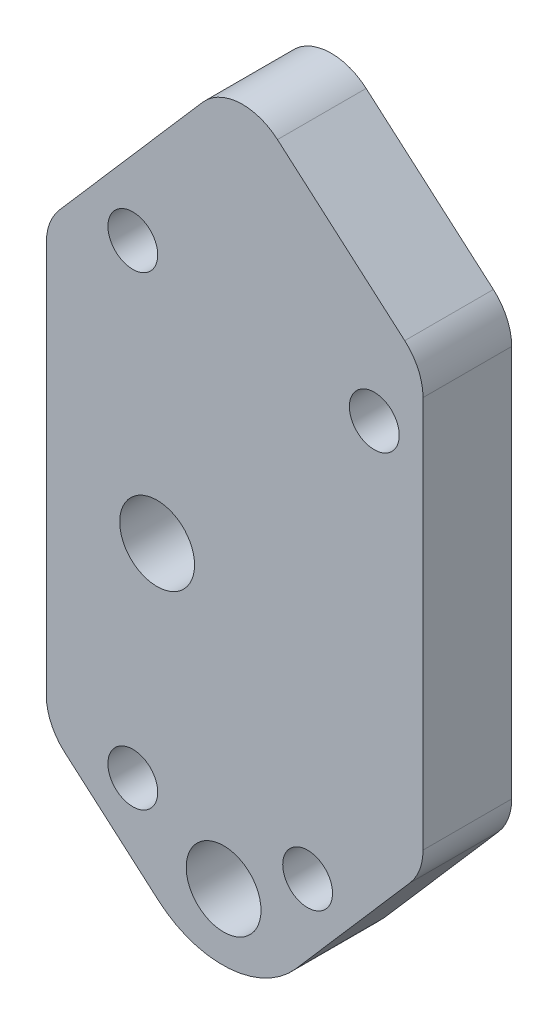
ISO-10303-21;
HEADER;
FILE_DESCRIPTION(('STEP AP214'),'2;1');
FILE_NAME('part.step','',(''),(''),'','','');
FILE_SCHEMA(('AUTOMOTIVE_DESIGN { 1 0 10303 214 1 1 1 1 }'));
ENDSEC;
DATA;
#1=APPLICATION_CONTEXT('core data for automotive mechanical design processes');
#2=APPLICATION_PROTOCOL_DEFINITION('international standard','automotive_design',2000,#1);
#3=PRODUCT_CONTEXT('',#1,'mechanical');
#4=PRODUCT('Part','Part','',(#3));
#5=PRODUCT_RELATED_PRODUCT_CATEGORY('part','',(#4));
#6=PRODUCT_DEFINITION_FORMATION('','',#4);
#7=PRODUCT_DEFINITION_CONTEXT('part definition',#1,'design');
#8=PRODUCT_DEFINITION('design','',#6,#7);
#9=PRODUCT_DEFINITION_SHAPE('','',#8);
#10=(LENGTH_UNIT() NAMED_UNIT(*) SI_UNIT(.MILLI.,.METRE.));
#11=(NAMED_UNIT(*) PLANE_ANGLE_UNIT() SI_UNIT($,.RADIAN.));
#12=(NAMED_UNIT(*) SI_UNIT($,.STERADIAN.) SOLID_ANGLE_UNIT());
#13=UNCERTAINTY_MEASURE_WITH_UNIT(LENGTH_MEASURE(1.E-05),#10,'distance_accuracy_value','');
#14=(GEOMETRIC_REPRESENTATION_CONTEXT(3) GLOBAL_UNCERTAINTY_ASSIGNED_CONTEXT((#13)) GLOBAL_UNIT_ASSIGNED_CONTEXT((#10,
#11,#12)) REPRESENTATION_CONTEXT('',''));
#15=CARTESIAN_POINT('',(0.,0.,0.));
#16=DIRECTION('',(0.,0.,1.));
#17=DIRECTION('',(1.,0.,0.));
#18=AXIS2_PLACEMENT_3D('',#15,#16,#17);
#19=CARTESIAN_POINT('',(-783.463,-50.7534898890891,84.6582));
#20=DIRECTION('',(0.,0.,-1.));
#21=DIRECTION('',(-1.,0.,0.));
#22=AXIS2_PLACEMENT_3D('',#19,#20,#21);
#23=CYLINDRICAL_SURFACE('',#22,7.61999999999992);
#24=CARTESIAN_POINT('',(-783.463,-50.7534898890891,71.9582));
#25=DIRECTION('',(0.,0.,-1.));
#26=DIRECTION('',(-1.,0.,0.));
#27=AXIS2_PLACEMENT_3D('',#24,#25,#26);
#28=CIRCLE('',#27,7.61999999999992);
#29=CARTESIAN_POINT('',(-775.843,-50.7534898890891,71.9582));
#30=VERTEX_POINT('',#29);
#31=CARTESIAN_POINT('',(-777.709670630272,-55.7498486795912,71.9582));
#32=VERTEX_POINT('',#31);
#33=EDGE_CURVE('E177',#30,#32,#28,.T.);
#34=ORIENTED_EDGE('',*,*,#33,.F.);
#35=DIRECTION('',(0.,0.,-1.));
#36=VECTOR('',#35,1.);
#37=CARTESIAN_POINT('',(-775.843,-50.7534898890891,84.6582));
#38=LINE('',#37,#36);
#39=CARTESIAN_POINT('',(-775.843,-50.7534898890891,84.6582));
#40=VERTEX_POINT('',#39);
#41=EDGE_CURVE('E11',#40,#30,#38,.T.);
#42=ORIENTED_EDGE('',*,*,#41,.F.);
#43=CARTESIAN_POINT('',(-783.463,-50.7534898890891,84.6582));
#44=DIRECTION('',(0.,0.,-1.));
#45=DIRECTION('',(-1.,0.,0.));
#46=AXIS2_PLACEMENT_3D('',#43,#44,#45);
#47=CIRCLE('',#46,7.61999999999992);
#48=CARTESIAN_POINT('',(-777.709670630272,-55.7498486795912,84.6582));
#49=VERTEX_POINT('',#48);
#50=EDGE_CURVE('E222',#40,#49,#47,.T.);
#51=ORIENTED_EDGE('',*,*,#50,.T.);
#52=DIRECTION('',(0.,0.,-1.));
#53=VECTOR('',#52,1.);
#54=CARTESIAN_POINT('',(-777.709670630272,-55.7498486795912,84.6582));
#55=LINE('',#54,#53);
#56=EDGE_CURVE('E52',#49,#32,#55,.T.);
#57=ORIENTED_EDGE('',*,*,#56,.T.);
#58=EDGE_LOOP('',(#34,#42,#51,#57));
#59=FACE_BOUND('',#58,.T.);
#60=ADVANCED_FACE('F49',(#59),#23,.T.);
#61=CARTESIAN_POINT('',(-775.843,5.39033140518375,84.6582));
#62=DIRECTION('',(1.,0.,0.));
#63=DIRECTION('',(0.,1.,0.));
#64=AXIS2_PLACEMENT_3D('',#61,#62,#63);
#65=PLANE('',#64);
#66=DIRECTION('',(0.,-1.,0.));
#67=VECTOR('',#66,1.);
#68=CARTESIAN_POINT('',(-775.843,5.39033140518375,71.9582));
#69=LINE('',#68,#67);
#70=CARTESIAN_POINT('',(-775.843,5.39033140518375,71.9582));
#71=VERTEX_POINT('',#70);
#72=EDGE_CURVE('E219',#71,#30,#69,.T.);
#73=ORIENTED_EDGE('',*,*,#72,.F.);
#74=DIRECTION('',(0.,0.,-1.));
#75=VECTOR('',#74,1.);
#76=CARTESIAN_POINT('',(-775.843,5.39033140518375,84.6582));
#77=LINE('',#76,#75);
#78=CARTESIAN_POINT('',(-775.843,5.39033140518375,84.6582));
#79=VERTEX_POINT('',#78);
#80=EDGE_CURVE('E59',#79,#71,#77,.T.);
#81=ORIENTED_EDGE('',*,*,#80,.F.);
#82=DIRECTION('',(0.,-1.,0.));
#83=VECTOR('',#82,1.);
#84=CARTESIAN_POINT('',(-775.843,5.39033140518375,84.6582));
#85=LINE('',#84,#83);
#86=EDGE_CURVE('E162',#79,#40,#85,.T.);
#87=ORIENTED_EDGE('',*,*,#86,.T.);
#88=ORIENTED_EDGE('',*,*,#41,.T.);
#89=EDGE_LOOP('',(#73,#81,#87,#88));
#90=FACE_BOUND('',#89,.T.);
#91=ADVANCED_FACE('F254',(#90),#65,.T.);
#92=CARTESIAN_POINT('',(-783.463,5.39033140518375,84.6582));
#93=DIRECTION('',(0.,0.,-1.));
#94=DIRECTION('',(-1.,0.,0.));
#95=AXIS2_PLACEMENT_3D('',#92,#93,#94);
#96=CYLINDRICAL_SURFACE('',#95,7.61999999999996);
#97=CARTESIAN_POINT('',(-783.463,5.39033140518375,71.9582));
#98=DIRECTION('',(0.,0.,-1.));
#99=DIRECTION('',(-1.,0.,0.));
#100=AXIS2_PLACEMENT_3D('',#97,#98,#99);
#101=CIRCLE('',#100,7.61999999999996);
#102=CARTESIAN_POINT('',(-778.466641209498,11.1436607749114,71.9582));
#103=VERTEX_POINT('',#102);
#104=EDGE_CURVE('E148',#103,#71,#101,.T.);
#105=ORIENTED_EDGE('',*,*,#104,.F.);
#106=DIRECTION('',(0.,0.,-1.));
#107=VECTOR('',#106,1.);
#108=CARTESIAN_POINT('',(-778.466641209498,11.1436607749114,84.6582));
#109=LINE('',#108,#107);
#110=CARTESIAN_POINT('',(-778.466641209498,11.1436607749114,84.6582));
#111=VERTEX_POINT('',#110);
#112=EDGE_CURVE('E143',#111,#103,#109,.T.);
#113=ORIENTED_EDGE('',*,*,#112,.F.);
#114=CARTESIAN_POINT('',(-783.463,5.39033140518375,84.6582));
#115=DIRECTION('',(0.,0.,-1.));
#116=DIRECTION('',(-1.,0.,0.));
#117=AXIS2_PLACEMENT_3D('',#114,#115,#116);
#118=CIRCLE('',#117,7.61999999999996);
#119=EDGE_CURVE('E146',#111,#79,#118,.T.);
#120=ORIENTED_EDGE('',*,*,#119,.T.);
#121=ORIENTED_EDGE('',*,*,#80,.T.);
#122=EDGE_LOOP('',(#105,#113,#120,#121));
#123=FACE_BOUND('',#122,.T.);
#124=ADVANCED_FACE('F145',(#123),#96,.T.);
#125=CARTESIAN_POINT('',(-796.698391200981,26.9766434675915,84.6582));
#126=DIRECTION('',(0.655690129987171,0.755030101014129,0.));
#127=DIRECTION('',(-0.755030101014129,0.655690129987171,0.));
#128=AXIS2_PLACEMENT_3D('',#125,#126,#127);
#129=PLANE('',#128);
#130=DIRECTION('',(0.755030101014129,-0.655690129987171,0.));
#131=VECTOR('',#130,1.);
#132=CARTESIAN_POINT('',(-796.698391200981,26.9766434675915,71.9582));
#133=LINE('',#132,#131);
#134=CARTESIAN_POINT('',(-796.698391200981,26.9766434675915,71.9582));
#135=VERTEX_POINT('',#134);
#136=EDGE_CURVE('E214',#135,#103,#133,.T.);
#137=ORIENTED_EDGE('',*,*,#136,.F.);
#138=DIRECTION('',(0.,0.,-1.));
#139=VECTOR('',#138,1.);
#140=CARTESIAN_POINT('',(-796.698391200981,26.9766434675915,84.6582));
#141=LINE('',#140,#139);
#142=CARTESIAN_POINT('',(-796.698391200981,26.9766434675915,84.6582));
#143=VERTEX_POINT('',#142);
#144=EDGE_CURVE('E154',#143,#135,#141,.T.);
#145=ORIENTED_EDGE('',*,*,#144,.F.);
#146=DIRECTION('',(0.755030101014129,-0.655690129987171,0.));
#147=VECTOR('',#146,1.);
#148=CARTESIAN_POINT('',(-796.698391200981,26.9766434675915,84.6582));
#149=LINE('',#148,#147);
#150=EDGE_CURVE('E160',#143,#111,#149,.T.);
#151=ORIENTED_EDGE('',*,*,#150,.T.);
#152=ORIENTED_EDGE('',*,*,#112,.T.);
#153=EDGE_LOOP('',(#137,#145,#151,#152));
#154=FACE_BOUND('',#153,.T.);
#155=ADVANCED_FACE('F165',(#154),#129,.T.);
#156=CARTESIAN_POINT('',(-801.694749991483,21.2233140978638,84.6582));
#157=DIRECTION('',(0.,0.,-1.));
#158=DIRECTION('',(-1.,0.,0.));
#159=AXIS2_PLACEMENT_3D('',#156,#157,#158);
#160=CYLINDRICAL_SURFACE('',#159,7.62000000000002);
#161=CARTESIAN_POINT('',(-801.694749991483,21.2233140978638,71.9582));
#162=DIRECTION('',(0.,0.,-1.));
#163=DIRECTION('',(-1.,0.,0.));
#164=AXIS2_PLACEMENT_3D('',#161,#162,#163);
#165=CIRCLE('',#164,7.62000000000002);
#166=CARTESIAN_POINT('',(-807.448079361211,26.2196728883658,71.9582));
#167=VERTEX_POINT('',#166);
#168=EDGE_CURVE('E210',#167,#135,#165,.T.);
#169=ORIENTED_EDGE('',*,*,#168,.F.);
#170=DIRECTION('',(0.,0.,-1.));
#171=VECTOR('',#170,1.);
#172=CARTESIAN_POINT('',(-807.448079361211,26.2196728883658,84.6582));
#173=LINE('',#172,#171);
#174=CARTESIAN_POINT('',(-807.448079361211,26.2196728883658,84.6582));
#175=VERTEX_POINT('',#174);
#176=EDGE_CURVE('E228',#175,#167,#173,.T.);
#177=ORIENTED_EDGE('',*,*,#176,.F.);
#178=CARTESIAN_POINT('',(-801.694749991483,21.2233140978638,84.6582));
#179=DIRECTION('',(0.,0.,-1.));
#180=DIRECTION('',(-1.,0.,0.));
#181=AXIS2_PLACEMENT_3D('',#178,#179,#180);
#182=CIRCLE('',#181,7.62000000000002);
#183=EDGE_CURVE('E167',#175,#143,#182,.T.);
#184=ORIENTED_EDGE('',*,*,#183,.T.);
#185=ORIENTED_EDGE('',*,*,#144,.T.);
#186=EDGE_LOOP('',(#169,#177,#184,#185));
#187=FACE_BOUND('',#186,.T.);
#188=ADVANCED_FACE('F267',(#187),#160,.T.);
#189=CARTESIAN_POINT('',(-827.951329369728,2.61008931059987,84.6582));
#190=DIRECTION('',(-0.755030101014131,0.655690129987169,0.));
#191=DIRECTION('',(-0.655690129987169,-0.755030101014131,0.));
#192=AXIS2_PLACEMENT_3D('',#189,#190,#191);
#193=PLANE('',#192);
#194=DIRECTION('',(0.655690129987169,0.755030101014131,0.));
#195=VECTOR('',#194,1.);
#196=CARTESIAN_POINT('',(-827.951329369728,2.61008931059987,71.9582));
#197=LINE('',#196,#195);
#198=CARTESIAN_POINT('',(-827.951329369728,2.61008931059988,71.9582));
#199=VERTEX_POINT('',#198);
#200=EDGE_CURVE('E206',#199,#167,#197,.T.);
#201=ORIENTED_EDGE('',*,*,#200,.F.);
#202=DIRECTION('',(0.,0.,-1.));
#203=VECTOR('',#202,1.);
#204=CARTESIAN_POINT('',(-827.951329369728,2.61008931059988,84.6582));
#205=LINE('',#204,#203);
#206=CARTESIAN_POINT('',(-827.951329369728,2.61008931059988,84.6582));
#207=VERTEX_POINT('',#206);
#208=EDGE_CURVE('E231',#207,#199,#205,.T.);
#209=ORIENTED_EDGE('',*,*,#208,.F.);
#210=DIRECTION('',(0.655690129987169,0.755030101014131,0.));
#211=VECTOR('',#210,1.);
#212=CARTESIAN_POINT('',(-827.951329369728,2.61008931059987,84.6582));
#213=LINE('',#212,#211);
#214=EDGE_CURVE('E171',#207,#175,#213,.T.);
#215=ORIENTED_EDGE('',*,*,#214,.T.);
#216=ORIENTED_EDGE('',*,*,#176,.T.);
#217=EDGE_LOOP('',(#201,#209,#215,#216));
#218=FACE_BOUND('',#217,.T.);
#219=ADVANCED_FACE('F270',(#218),#193,.T.);
#220=CARTESIAN_POINT('',(-822.198,-2.38626947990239,84.6582));
#221=DIRECTION('',(0.,0.,-1.));
#222=DIRECTION('',(-1.,0.,0.));
#223=AXIS2_PLACEMENT_3D('',#220,#221,#222);
#224=CYLINDRICAL_SURFACE('',#223,7.62000000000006);
#225=CARTESIAN_POINT('',(-822.198,-2.38626947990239,71.9582));
#226=DIRECTION('',(0.,0.,-1.));
#227=DIRECTION('',(-1.,0.,0.));
#228=AXIS2_PLACEMENT_3D('',#225,#226,#227);
#229=CIRCLE('',#228,7.62000000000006);
#230=CARTESIAN_POINT('',(-829.818,-2.38626947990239,71.9582));
#231=VERTEX_POINT('',#230);
#232=EDGE_CURVE('E202',#231,#199,#229,.T.);
#233=ORIENTED_EDGE('',*,*,#232,.F.);
#234=DIRECTION('',(0.,0.,-1.));
#235=VECTOR('',#234,1.);
#236=CARTESIAN_POINT('',(-829.818,-2.38626947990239,84.6582));
#237=LINE('',#236,#235);
#238=CARTESIAN_POINT('',(-829.818,-2.38626947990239,84.6582));
#239=VERTEX_POINT('',#238);
#240=EDGE_CURVE('E234',#239,#231,#237,.T.);
#241=ORIENTED_EDGE('',*,*,#240,.F.);
#242=CARTESIAN_POINT('',(-822.198,-2.38626947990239,84.6582));
#243=DIRECTION('',(0.,0.,-1.));
#244=DIRECTION('',(-1.,0.,0.));
#245=AXIS2_PLACEMENT_3D('',#242,#243,#244);
#246=CIRCLE('',#245,7.62000000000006);
#247=EDGE_CURVE('E438',#239,#207,#246,.T.);
#248=ORIENTED_EDGE('',*,*,#247,.T.);
#249=ORIENTED_EDGE('',*,*,#208,.T.);
#250=EDGE_LOOP('',(#233,#241,#248,#249));
#251=FACE_BOUND('',#250,.T.);
#252=ADVANCED_FACE('F274',(#251),#224,.T.);
#253=CARTESIAN_POINT('',(-829.818,-58.5300907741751,84.6582));
#254=DIRECTION('',(-1.,0.,0.));
#255=DIRECTION('',(0.,-1.,0.));
#256=AXIS2_PLACEMENT_3D('',#253,#254,#255);
#257=PLANE('',#256);
#258=DIRECTION('',(0.,1.,0.));
#259=VECTOR('',#258,1.);
#260=CARTESIAN_POINT('',(-829.818,-58.5300907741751,71.9582));
#261=LINE('',#260,#259);
#262=CARTESIAN_POINT('',(-829.818,-58.5300907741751,71.9582));
#263=VERTEX_POINT('',#262);
#264=EDGE_CURVE('E198',#263,#231,#261,.T.);
#265=ORIENTED_EDGE('',*,*,#264,.F.);
#266=DIRECTION('',(0.,0.,-1.));
#267=VECTOR('',#266,1.);
#268=CARTESIAN_POINT('',(-829.818,-58.5300907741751,84.6582));
#269=LINE('',#268,#267);
#270=CARTESIAN_POINT('',(-829.818,-58.5300907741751,84.6582));
#271=VERTEX_POINT('',#270);
#272=EDGE_CURVE('E237',#271,#263,#269,.T.);
#273=ORIENTED_EDGE('',*,*,#272,.F.);
#274=DIRECTION('',(0.,1.,0.));
#275=VECTOR('',#274,1.);
#276=CARTESIAN_POINT('',(-829.818,-58.5300907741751,84.6582));
#277=LINE('',#276,#275);
#278=EDGE_CURVE('E434',#271,#239,#277,.T.);
#279=ORIENTED_EDGE('',*,*,#278,.T.);
#280=ORIENTED_EDGE('',*,*,#240,.T.);
#281=EDGE_LOOP('',(#265,#273,#279,#280));
#282=FACE_BOUND('',#281,.T.);
#283=ADVANCED_FACE('F278',(#282),#257,.T.);
#284=CARTESIAN_POINT('',(-822.198,-58.5300907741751,84.6582));
#285=DIRECTION('',(0.,0.,-1.));
#286=DIRECTION('',(-1.,0.,0.));
#287=AXIS2_PLACEMENT_3D('',#284,#285,#286);
#288=CYLINDRICAL_SURFACE('',#287,7.61999999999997);
#289=CARTESIAN_POINT('',(-822.198,-58.5300907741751,71.9582));
#290=DIRECTION('',(0.,0.,-1.));
#291=DIRECTION('',(-1.,0.,0.));
#292=AXIS2_PLACEMENT_3D('',#289,#290,#291);
#293=CIRCLE('',#292,7.61999999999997);
#294=CARTESIAN_POINT('',(-827.194358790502,-64.2834201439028,71.9582));
#295=VERTEX_POINT('',#294);
#296=EDGE_CURVE('E194',#295,#263,#293,.T.);
#297=ORIENTED_EDGE('',*,*,#296,.F.);
#298=DIRECTION('',(0.,0.,-1.));
#299=VECTOR('',#298,1.);
#300=CARTESIAN_POINT('',(-827.194358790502,-64.2834201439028,84.6582));
#301=LINE('',#300,#299);
#302=CARTESIAN_POINT('',(-827.194358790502,-64.2834201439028,84.6582));
#303=VERTEX_POINT('',#302);
#304=EDGE_CURVE('E240',#303,#295,#301,.T.);
#305=ORIENTED_EDGE('',*,*,#304,.F.);
#306=CARTESIAN_POINT('',(-822.198,-58.5300907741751,84.6582));
#307=DIRECTION('',(0.,0.,-1.));
#308=DIRECTION('',(-1.,0.,0.));
#309=AXIS2_PLACEMENT_3D('',#306,#307,#308);
#310=CIRCLE('',#309,7.61999999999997);
#311=EDGE_CURVE('E430',#303,#271,#310,.T.);
#312=ORIENTED_EDGE('',*,*,#311,.T.);
#313=ORIENTED_EDGE('',*,*,#272,.T.);
#314=EDGE_LOOP('',(#297,#305,#312,#313));
#315=FACE_BOUND('',#314,.T.);
#316=ADVANCED_FACE('F282',(#315),#288,.T.);
#317=CARTESIAN_POINT('',(-813.757049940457,-75.9527705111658,84.6582));
#318=DIRECTION('',(-0.65569012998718,-0.755030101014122,0.));
#319=DIRECTION('',(0.755030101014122,-0.65569012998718,0.));
#320=AXIS2_PLACEMENT_3D('',#317,#318,#319);
#321=PLANE('',#320);
#322=DIRECTION('',(-0.755030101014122,0.65569012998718,0.));
#323=VECTOR('',#322,1.);
#324=CARTESIAN_POINT('',(-813.757049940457,-75.9527705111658,71.9582));
#325=LINE('',#324,#323);
#326=CARTESIAN_POINT('',(-813.757049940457,-75.9527705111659,71.9582));
#327=VERTEX_POINT('',#326);
#328=EDGE_CURVE('E190',#327,#295,#325,.T.);
#329=ORIENTED_EDGE('',*,*,#328,.F.);
#330=DIRECTION('',(0.,0.,-1.));
#331=VECTOR('',#330,1.);
#332=CARTESIAN_POINT('',(-813.757049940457,-75.9527705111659,84.6582));
#333=LINE('',#332,#331);
#334=CARTESIAN_POINT('',(-813.757049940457,-75.9527705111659,84.6582));
#335=VERTEX_POINT('',#334);
#336=EDGE_CURVE('E243',#335,#327,#333,.T.);
#337=ORIENTED_EDGE('',*,*,#336,.F.);
#338=DIRECTION('',(-0.755030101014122,0.65569012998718,0.));
#339=VECTOR('',#338,1.);
#340=CARTESIAN_POINT('',(-813.757049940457,-75.9527705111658,84.6582));
#341=LINE('',#340,#339);
#342=EDGE_CURVE('E426',#335,#303,#341,.T.);
#343=ORIENTED_EDGE('',*,*,#342,.T.);
#344=ORIENTED_EDGE('',*,*,#304,.T.);
#345=EDGE_LOOP('',(#329,#337,#343,#344));
#346=FACE_BOUND('',#345,.T.);
#347=ADVANCED_FACE('F286',(#346),#321,.T.);
#348=CARTESIAN_POINT('',(-804.597058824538,-65.405,84.6582));
#349=DIRECTION('',(0.,0.,-1.));
#350=DIRECTION('',(-1.,0.,0.));
#351=AXIS2_PLACEMENT_3D('',#348,#349,#350);
#352=CYLINDRICAL_SURFACE('',#351,13.9699999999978);
#353=CARTESIAN_POINT('',(-804.597058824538,-65.405,71.9582));
#354=DIRECTION('',(0.,0.,-1.));
#355=DIRECTION('',(-1.,0.,0.));
#356=AXIS2_PLACEMENT_3D('',#353,#354,#355);
#357=CIRCLE('',#356,13.9699999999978);
#358=CARTESIAN_POINT('',(-794.049288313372,-74.5649911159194,71.9582));
#359=VERTEX_POINT('',#358);
#360=EDGE_CURVE('E186',#359,#327,#357,.T.);
#361=ORIENTED_EDGE('',*,*,#360,.F.);
#362=DIRECTION('',(0.,0.,-1.));
#363=VECTOR('',#362,1.);
#364=CARTESIAN_POINT('',(-794.049288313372,-74.5649911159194,84.6582));
#365=LINE('',#364,#363);
#366=CARTESIAN_POINT('',(-794.049288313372,-74.5649911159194,84.6582));
#367=VERTEX_POINT('',#366);
#368=EDGE_CURVE('E245',#367,#359,#365,.T.);
#369=ORIENTED_EDGE('',*,*,#368,.F.);
#370=CARTESIAN_POINT('',(-804.597058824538,-65.405,84.6582));
#371=DIRECTION('',(0.,0.,-1.));
#372=DIRECTION('',(-1.,0.,0.));
#373=AXIS2_PLACEMENT_3D('',#370,#371,#372);
#374=CIRCLE('',#373,13.9699999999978);
#375=EDGE_CURVE('E422',#367,#335,#374,.T.);
#376=ORIENTED_EDGE('',*,*,#375,.T.);
#377=ORIENTED_EDGE('',*,*,#336,.T.);
#378=EDGE_LOOP('',(#361,#369,#376,#377));
#379=FACE_BOUND('',#378,.T.);
#380=ADVANCED_FACE('F290',(#379),#352,.T.);
#381=CARTESIAN_POINT('',(-777.709670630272,-55.7498486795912,84.6582));
#382=DIRECTION('',(0.755030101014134,-0.655690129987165,0.));
#383=DIRECTION('',(0.655690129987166,0.755030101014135,0.));
#384=AXIS2_PLACEMENT_3D('',#381,#382,#383);
#385=PLANE('',#384);
#386=DIRECTION('',(-0.655690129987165,-0.755030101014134,0.));
#387=VECTOR('',#386,1.);
#388=CARTESIAN_POINT('',(-777.709670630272,-55.7498486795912,71.9582));
#389=LINE('',#388,#387);
#390=EDGE_CURVE('E181',#32,#359,#389,.T.);
#391=ORIENTED_EDGE('',*,*,#390,.F.);
#392=ORIENTED_EDGE('',*,*,#56,.F.);
#393=DIRECTION('',(-0.655690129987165,-0.755030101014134,0.));
#394=VECTOR('',#393,1.);
#395=CARTESIAN_POINT('',(-777.709670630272,-55.7498486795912,84.6582));
#396=LINE('',#395,#394);
#397=EDGE_CURVE('E419',#49,#367,#396,.T.);
#398=ORIENTED_EDGE('',*,*,#397,.T.);
#399=ORIENTED_EDGE('',*,*,#368,.T.);
#400=EDGE_LOOP('',(#391,#392,#398,#399));
#401=FACE_BOUND('',#400,.T.);
#402=ADVANCED_FACE('F251',(#401),#385,.T.);
#403=CARTESIAN_POINT('',(-783.463,-50.7534898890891,84.6582));
#404=DIRECTION('',(0.,0.,-1.));
#405=DIRECTION('',(-1.,0.,0.));
#406=AXIS2_PLACEMENT_3D('',#403,#404,#405);
#407=PLANE('',#406);
#408=CARTESIAN_POINT('',(-804.418,-69.846392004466,84.6582));
#409=DIRECTION('',(0.,0.,1.));
#410=DIRECTION('',(1.,0.,0.));
#411=AXIS2_PLACEMENT_3D('',#408,#409,#410);
#412=CIRCLE('',#411,5.35940000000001);
#413=CARTESIAN_POINT('',(-799.0586,-69.846392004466,84.6582));
#414=VERTEX_POINT('',#413);
#415=EDGE_CURVE('E363',#414,#414,#412,.T.);
#416=ORIENTED_EDGE('',*,*,#415,.F.);
#417=EDGE_LOOP('',(#416));
#418=FACE_BOUND('',#417,.T.);
#419=CARTESIAN_POINT('',(-813.943,-31.7499999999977,84.6582));
#420=DIRECTION('',(0.,0.,1.));
#421=DIRECTION('',(1.,0.,0.));
#422=AXIS2_PLACEMENT_3D('',#419,#420,#421);
#423=CIRCLE('',#422,5.35940000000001);
#424=CARTESIAN_POINT('',(-808.5836,-31.7499999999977,84.6582));
#425=VERTEX_POINT('',#424);
#426=EDGE_CURVE('E382',#425,#425,#423,.T.);
#427=ORIENTED_EDGE('',*,*,#426,.F.);
#428=EDGE_LOOP('',(#427));
#429=FACE_BOUND('',#428,.T.);
#430=CARTESIAN_POINT('',(-782.828,-1.00168590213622,84.6582));
#431=DIRECTION('',(0.,0.,-1.));
#432=DIRECTION('',(-1.,0.,0.));
#433=AXIS2_PLACEMENT_3D('',#430,#431,#432);
#434=CIRCLE('',#433,3.56869999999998);
#435=CARTESIAN_POINT('',(-786.3967,-1.00168590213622,84.6582));
#436=VERTEX_POINT('',#435);
#437=EDGE_CURVE('E386',#436,#436,#434,.T.);
#438=ORIENTED_EDGE('',*,*,#437,.T.);
#439=EDGE_LOOP('',(#438));
#440=FACE_BOUND('',#439,.T.);
#441=CARTESIAN_POINT('',(-817.424993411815,4.07831409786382,84.6582));
#442=DIRECTION('',(0.,0.,-1.));
#443=DIRECTION('',(-1.,0.,0.));
#444=AXIS2_PLACEMENT_3D('',#441,#442,#443);
#445=CIRCLE('',#444,3.56869999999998);
#446=CARTESIAN_POINT('',(-820.993693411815,4.07831409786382,84.6582));
#447=VERTEX_POINT('',#446);
#448=EDGE_CURVE('E394',#447,#447,#445,.T.);
#449=ORIENTED_EDGE('',*,*,#448,.T.);
#450=EDGE_LOOP('',(#449));
#451=FACE_BOUND('',#450,.T.);
#452=CARTESIAN_POINT('',(-792.378161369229,-62.5966859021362,84.6582));
#453=DIRECTION('',(0.,0.,-1.));
#454=DIRECTION('',(-1.,0.,0.));
#455=AXIS2_PLACEMENT_3D('',#452,#453,#454);
#456=CIRCLE('',#455,3.56869999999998);
#457=CARTESIAN_POINT('',(-795.946861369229,-62.5966859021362,84.6582));
#458=VERTEX_POINT('',#457);
#459=EDGE_CURVE('E402',#458,#458,#456,.T.);
#460=ORIENTED_EDGE('',*,*,#459,.T.);
#461=EDGE_LOOP('',(#460));
#462=FACE_BOUND('',#461,.T.);
#463=CARTESIAN_POINT('',(-817.424993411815,-62.5966859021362,84.6582));
#464=DIRECTION('',(0.,0.,-1.));
#465=DIRECTION('',(-1.,0.,0.));
#466=AXIS2_PLACEMENT_3D('',#463,#464,#465);
#467=CIRCLE('',#466,3.56869999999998);
#468=CARTESIAN_POINT('',(-820.993693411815,-62.5966859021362,84.6582));
#469=VERTEX_POINT('',#468);
#470=EDGE_CURVE('E410',#469,#469,#467,.T.);
#471=ORIENTED_EDGE('',*,*,#470,.T.);
#472=EDGE_LOOP('',(#471));
#473=FACE_BOUND('',#472,.T.);
#474=ORIENTED_EDGE('',*,*,#50,.F.);
#475=ORIENTED_EDGE('',*,*,#86,.F.);
#476=ORIENTED_EDGE('',*,*,#119,.F.);
#477=ORIENTED_EDGE('',*,*,#150,.F.);
#478=ORIENTED_EDGE('',*,*,#183,.F.);
#479=ORIENTED_EDGE('',*,*,#214,.F.);
#480=ORIENTED_EDGE('',*,*,#247,.F.);
#481=ORIENTED_EDGE('',*,*,#278,.F.);
#482=ORIENTED_EDGE('',*,*,#311,.F.);
#483=ORIENTED_EDGE('',*,*,#342,.F.);
#484=ORIENTED_EDGE('',*,*,#375,.F.);
#485=ORIENTED_EDGE('',*,*,#397,.F.);
#486=EDGE_LOOP('',(#474,#475,#476,#477,#478,#479,#480,#481,#482,#483,#484,#485));
#487=FACE_BOUND('',#486,.T.);
#488=ADVANCED_FACE('F158',(#418,#429,#440,#451,#462,#473,#487),#407,.F.);
#489=CARTESIAN_POINT('',(-783.463,-50.7534898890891,71.9582));
#490=DIRECTION('',(0.,0.,-1.));
#491=DIRECTION('',(-1.,0.,0.));
#492=AXIS2_PLACEMENT_3D('',#489,#490,#491);
#493=PLANE('',#492);
#494=CARTESIAN_POINT('',(-804.418,-69.846392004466,71.9582));
#495=DIRECTION('',(0.,0.,1.));
#496=DIRECTION('',(1.,0.,0.));
#497=AXIS2_PLACEMENT_3D('',#494,#495,#496);
#498=CIRCLE('',#497,3.56869999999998);
#499=CARTESIAN_POINT('',(-800.8493,-69.846392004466,71.9582));
#500=VERTEX_POINT('',#499);
#501=EDGE_CURVE('E352',#500,#500,#498,.T.);
#502=ORIENTED_EDGE('',*,*,#501,.T.);
#503=EDGE_LOOP('',(#502));
#504=FACE_BOUND('',#503,.T.);
#505=CARTESIAN_POINT('',(-813.943,-31.7499999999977,71.9582));
#506=DIRECTION('',(0.,0.,1.));
#507=DIRECTION('',(1.,0.,0.));
#508=AXIS2_PLACEMENT_3D('',#505,#506,#507);
#509=CIRCLE('',#508,3.56869999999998);
#510=CARTESIAN_POINT('',(-810.3743,-31.7499999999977,71.9582));
#511=VERTEX_POINT('',#510);
#512=EDGE_CURVE('E370',#511,#511,#509,.T.);
#513=ORIENTED_EDGE('',*,*,#512,.T.);
#514=EDGE_LOOP('',(#513));
#515=FACE_BOUND('',#514,.T.);
#516=CARTESIAN_POINT('',(-782.828,-1.00168590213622,71.9582));
#517=DIRECTION('',(0.,0.,-1.));
#518=DIRECTION('',(-1.,0.,0.));
#519=AXIS2_PLACEMENT_3D('',#516,#517,#518);
#520=CIRCLE('',#519,3.56869999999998);
#521=CARTESIAN_POINT('',(-786.3967,-1.00168590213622,71.9582));
#522=VERTEX_POINT('',#521);
#523=EDGE_CURVE('E390',#522,#522,#520,.T.);
#524=ORIENTED_EDGE('',*,*,#523,.F.);
#525=EDGE_LOOP('',(#524));
#526=FACE_BOUND('',#525,.T.);
#527=CARTESIAN_POINT('',(-817.424993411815,4.07831409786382,71.9582));
#528=DIRECTION('',(0.,0.,-1.));
#529=DIRECTION('',(-1.,0.,0.));
#530=AXIS2_PLACEMENT_3D('',#527,#528,#529);
#531=CIRCLE('',#530,3.56869999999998);
#532=CARTESIAN_POINT('',(-820.993693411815,4.07831409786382,71.9582));
#533=VERTEX_POINT('',#532);
#534=EDGE_CURVE('E398',#533,#533,#531,.T.);
#535=ORIENTED_EDGE('',*,*,#534,.F.);
#536=EDGE_LOOP('',(#535));
#537=FACE_BOUND('',#536,.T.);
#538=CARTESIAN_POINT('',(-792.378161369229,-62.5966859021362,71.9582));
#539=DIRECTION('',(0.,0.,-1.));
#540=DIRECTION('',(-1.,0.,0.));
#541=AXIS2_PLACEMENT_3D('',#538,#539,#540);
#542=CIRCLE('',#541,3.56869999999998);
#543=CARTESIAN_POINT('',(-795.946861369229,-62.5966859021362,71.9582));
#544=VERTEX_POINT('',#543);
#545=EDGE_CURVE('E406',#544,#544,#542,.T.);
#546=ORIENTED_EDGE('',*,*,#545,.F.);
#547=EDGE_LOOP('',(#546));
#548=FACE_BOUND('',#547,.T.);
#549=CARTESIAN_POINT('',(-817.424993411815,-62.5966859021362,71.9582));
#550=DIRECTION('',(0.,0.,-1.));
#551=DIRECTION('',(-1.,0.,0.));
#552=AXIS2_PLACEMENT_3D('',#549,#550,#551);
#553=CIRCLE('',#552,3.56869999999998);
#554=CARTESIAN_POINT('',(-820.993693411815,-62.5966859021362,71.9582));
#555=VERTEX_POINT('',#554);
#556=EDGE_CURVE('E182',#555,#555,#553,.T.);
#557=ORIENTED_EDGE('',*,*,#556,.F.);
#558=EDGE_LOOP('',(#557));
#559=FACE_BOUND('',#558,.T.);
#560=ORIENTED_EDGE('',*,*,#33,.T.);
#561=ORIENTED_EDGE('',*,*,#390,.T.);
#562=ORIENTED_EDGE('',*,*,#360,.T.);
#563=ORIENTED_EDGE('',*,*,#328,.T.);
#564=ORIENTED_EDGE('',*,*,#296,.T.);
#565=ORIENTED_EDGE('',*,*,#264,.T.);
#566=ORIENTED_EDGE('',*,*,#232,.T.);
#567=ORIENTED_EDGE('',*,*,#200,.T.);
#568=ORIENTED_EDGE('',*,*,#168,.T.);
#569=ORIENTED_EDGE('',*,*,#136,.T.);
#570=ORIENTED_EDGE('',*,*,#104,.T.);
#571=ORIENTED_EDGE('',*,*,#72,.T.);
#572=EDGE_LOOP('',(#560,#561,#562,#563,#564,#565,#566,#567,#568,#569,#570,#571));
#573=FACE_BOUND('',#572,.T.);
#574=ADVANCED_FACE('F253',(#504,#515,#526,#537,#548,#559,#573),#493,.T.);
#575=CARTESIAN_POINT('',(-817.424993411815,-62.5966859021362,71.9582));
#576=DIRECTION('',(0.,0.,-1.));
#577=DIRECTION('',(-1.,0.,0.));
#578=AXIS2_PLACEMENT_3D('',#575,#576,#577);
#579=CYLINDRICAL_SURFACE('',#578,3.56869999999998);
#580=ORIENTED_EDGE('',*,*,#470,.F.);
#581=EDGE_LOOP('',(#580));
#582=FACE_BOUND('',#581,.T.);
#583=ORIENTED_EDGE('',*,*,#556,.T.);
#584=EDGE_LOOP('',(#583));
#585=FACE_BOUND('',#584,.T.);
#586=ADVANCED_FACE('F304',(#582,#585),#579,.F.);
#587=CARTESIAN_POINT('',(-792.378161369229,-62.5966859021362,71.9582));
#588=DIRECTION('',(0.,0.,-1.));
#589=DIRECTION('',(-1.,0.,0.));
#590=AXIS2_PLACEMENT_3D('',#587,#588,#589);
#591=CYLINDRICAL_SURFACE('',#590,3.56869999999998);
#592=ORIENTED_EDGE('',*,*,#459,.F.);
#593=EDGE_LOOP('',(#592));
#594=FACE_BOUND('',#593,.T.);
#595=ORIENTED_EDGE('',*,*,#545,.T.);
#596=EDGE_LOOP('',(#595));
#597=FACE_BOUND('',#596,.T.);
#598=ADVANCED_FACE('F311',(#594,#597),#591,.F.);
#599=CARTESIAN_POINT('',(-817.424993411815,4.07831409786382,71.9582));
#600=DIRECTION('',(0.,0.,-1.));
#601=DIRECTION('',(-1.,0.,0.));
#602=AXIS2_PLACEMENT_3D('',#599,#600,#601);
#603=CYLINDRICAL_SURFACE('',#602,3.56869999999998);
#604=ORIENTED_EDGE('',*,*,#448,.F.);
#605=EDGE_LOOP('',(#604));
#606=FACE_BOUND('',#605,.T.);
#607=ORIENTED_EDGE('',*,*,#534,.T.);
#608=EDGE_LOOP('',(#607));
#609=FACE_BOUND('',#608,.T.);
#610=ADVANCED_FACE('F315',(#606,#609),#603,.F.);
#611=CARTESIAN_POINT('',(-782.828,-1.00168590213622,71.9582));
#612=DIRECTION('',(0.,0.,-1.));
#613=DIRECTION('',(-1.,0.,0.));
#614=AXIS2_PLACEMENT_3D('',#611,#612,#613);
#615=CYLINDRICAL_SURFACE('',#614,3.56869999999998);
#616=ORIENTED_EDGE('',*,*,#437,.F.);
#617=EDGE_LOOP('',(#616));
#618=FACE_BOUND('',#617,.T.);
#619=ORIENTED_EDGE('',*,*,#523,.T.);
#620=EDGE_LOOP('',(#619));
#621=FACE_BOUND('',#620,.T.);
#622=ADVANCED_FACE('F319',(#618,#621),#615,.F.);
#623=CARTESIAN_POINT('',(-813.943,-31.7499999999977,84.6582));
#624=DIRECTION('',(0.,0.,1.));
#625=DIRECTION('',(1.,0.,0.));
#626=AXIS2_PLACEMENT_3D('',#623,#624,#625);
#627=CYLINDRICAL_SURFACE('',#626,5.35940000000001);
#628=CARTESIAN_POINT('',(-813.943,-31.7499999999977,76.7842));
#629=DIRECTION('',(0.,0.,1.));
#630=DIRECTION('',(1.,0.,0.));
#631=AXIS2_PLACEMENT_3D('',#628,#629,#630);
#632=CIRCLE('',#631,5.35940000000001);
#633=CARTESIAN_POINT('',(-808.5836,-31.7499999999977,76.7842));
#634=VERTEX_POINT('',#633);
#635=EDGE_CURVE('E378',#634,#634,#632,.T.);
#636=ORIENTED_EDGE('',*,*,#635,.F.);
#637=EDGE_LOOP('',(#636));
#638=FACE_BOUND('',#637,.T.);
#639=ORIENTED_EDGE('',*,*,#426,.T.);
#640=EDGE_LOOP('',(#639));
#641=FACE_BOUND('',#640,.T.);
#642=ADVANCED_FACE('F323',(#638,#641),#627,.F.);
#643=CARTESIAN_POINT('',(-810.3743,-31.7499999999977,76.7842));
#644=DIRECTION('',(0.,0.,-1.));
#645=DIRECTION('',(-1.,0.,0.));
#646=AXIS2_PLACEMENT_3D('',#643,#644,#645);
#647=PLANE('',#646);
#648=CARTESIAN_POINT('',(-813.943,-31.7499999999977,76.7842));
#649=DIRECTION('',(0.,0.,1.));
#650=DIRECTION('',(1.,0.,0.));
#651=AXIS2_PLACEMENT_3D('',#648,#649,#650);
#652=CIRCLE('',#651,3.56869999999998);
#653=CARTESIAN_POINT('',(-810.3743,-31.7499999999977,76.7842));
#654=VERTEX_POINT('',#653);
#655=EDGE_CURVE('E374',#654,#654,#652,.T.);
#656=ORIENTED_EDGE('',*,*,#655,.F.);
#657=EDGE_LOOP('',(#656));
#658=FACE_BOUND('',#657,.T.);
#659=ORIENTED_EDGE('',*,*,#635,.T.);
#660=EDGE_LOOP('',(#659));
#661=FACE_BOUND('',#660,.T.);
#662=ADVANCED_FACE('F327',(#658,#661),#647,.F.);
#663=CARTESIAN_POINT('',(-813.943,-31.7499999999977,84.6582));
#664=DIRECTION('',(0.,0.,1.));
#665=DIRECTION('',(1.,0.,0.));
#666=AXIS2_PLACEMENT_3D('',#663,#664,#665);
#667=CYLINDRICAL_SURFACE('',#666,3.56869999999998);
#668=ORIENTED_EDGE('',*,*,#512,.F.);
#669=EDGE_LOOP('',(#668));
#670=FACE_BOUND('',#669,.T.);
#671=ORIENTED_EDGE('',*,*,#655,.T.);
#672=EDGE_LOOP('',(#671));
#673=FACE_BOUND('',#672,.T.);
#674=ADVANCED_FACE('F331',(#670,#673),#667,.F.);
#675=CARTESIAN_POINT('',(-804.418,-69.846392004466,84.6582));
#676=DIRECTION('',(0.,0.,1.));
#677=DIRECTION('',(1.,0.,0.));
#678=AXIS2_PLACEMENT_3D('',#675,#676,#677);
#679=CYLINDRICAL_SURFACE('',#678,5.35940000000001);
#680=CARTESIAN_POINT('',(-804.418,-69.846392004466,76.7842));
#681=DIRECTION('',(0.,0.,1.));
#682=DIRECTION('',(1.,0.,0.));
#683=AXIS2_PLACEMENT_3D('',#680,#681,#682);
#684=CIRCLE('',#683,5.35940000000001);
#685=CARTESIAN_POINT('',(-799.0586,-69.846392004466,76.7842));
#686=VERTEX_POINT('',#685);
#687=EDGE_CURVE('E357',#686,#686,#684,.T.);
#688=ORIENTED_EDGE('',*,*,#687,.F.);
#689=EDGE_LOOP('',(#688));
#690=FACE_BOUND('',#689,.T.);
#691=ORIENTED_EDGE('',*,*,#415,.T.);
#692=EDGE_LOOP('',(#691));
#693=FACE_BOUND('',#692,.T.);
#694=ADVANCED_FACE('F335',(#690,#693),#679,.F.);
#695=CARTESIAN_POINT('',(-800.8493,-69.846392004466,76.7842));
#696=DIRECTION('',(0.,0.,-1.));
#697=DIRECTION('',(-1.,0.,0.));
#698=AXIS2_PLACEMENT_3D('',#695,#696,#697);
#699=PLANE('',#698);
#700=CARTESIAN_POINT('',(-804.418,-69.846392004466,76.7842));
#701=DIRECTION('',(0.,0.,1.));
#702=DIRECTION('',(1.,0.,0.));
#703=AXIS2_PLACEMENT_3D('',#700,#701,#702);
#704=CIRCLE('',#703,3.56869999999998);
#705=CARTESIAN_POINT('',(-800.8493,-69.846392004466,76.7842));
#706=VERTEX_POINT('',#705);
#707=EDGE_CURVE('E355',#706,#706,#704,.T.);
#708=ORIENTED_EDGE('',*,*,#707,.F.);
#709=EDGE_LOOP('',(#708));
#710=FACE_BOUND('',#709,.T.);
#711=ORIENTED_EDGE('',*,*,#687,.T.);
#712=EDGE_LOOP('',(#711));
#713=FACE_BOUND('',#712,.T.);
#714=ADVANCED_FACE('F339',(#710,#713),#699,.F.);
#715=CARTESIAN_POINT('',(-804.418,-69.846392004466,84.6582));
#716=DIRECTION('',(0.,0.,1.));
#717=DIRECTION('',(1.,0.,0.));
#718=AXIS2_PLACEMENT_3D('',#715,#716,#717);
#719=CYLINDRICAL_SURFACE('',#718,3.56869999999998);
#720=ORIENTED_EDGE('',*,*,#501,.F.);
#721=EDGE_LOOP('',(#720));
#722=FACE_BOUND('',#721,.T.);
#723=ORIENTED_EDGE('',*,*,#707,.T.);
#724=EDGE_LOOP('',(#723));
#725=FACE_BOUND('',#724,.T.);
#726=ADVANCED_FACE('F343',(#722,#725),#719,.F.);
#727=CLOSED_SHELL('',(#60,#91,#124,#155,#188,#219,#252,#283,#316,#347,#380,#402,#488,#574,#586,
#598,#610,#622,#642,#662,#674,#694,#714,#726));
#728=MANIFOLD_SOLID_BREP('B2',#727);
#729=ADVANCED_BREP_SHAPE_REPRESENTATION('',(#18,#728),#14);
#730=SHAPE_DEFINITION_REPRESENTATION(#9,#729);
ENDSEC;
END-ISO-10303-21;
